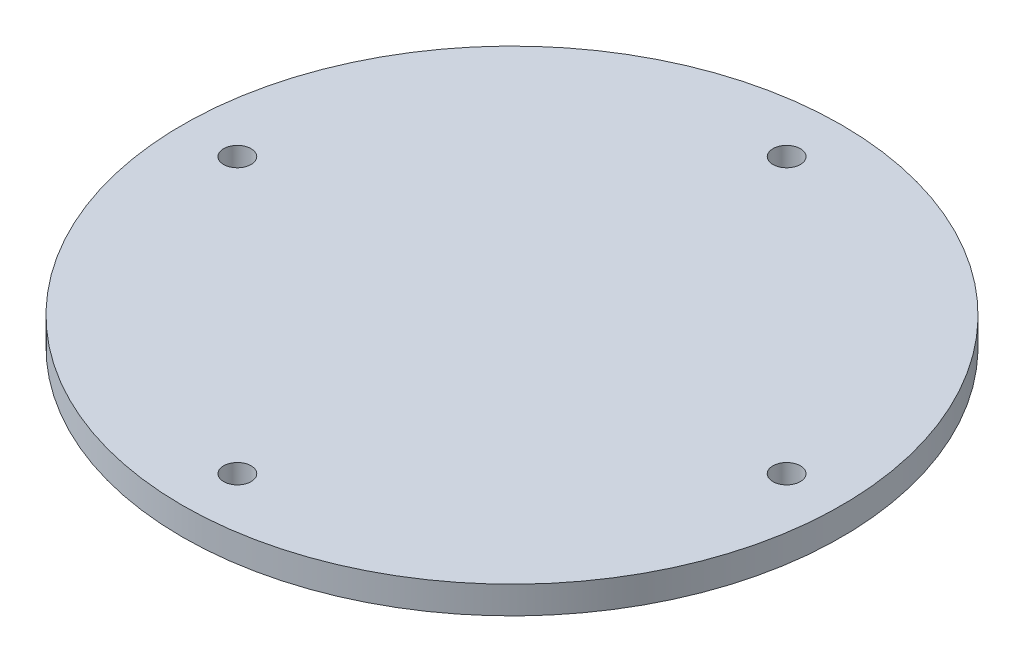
from build123d import *

# Parameters (mm, degrees)
SKETCH1_R           = 30
SKETCH1_R_2         = 1.25
BOSS_EXTRUDE1_DEPTH = 2.5


with BuildPart() as part:
    # Sketch1 → Boss-Extrude1 (new body)
    with BuildSketch(Plane(origin=(0, 0, 0), x_dir=(1, 0, 0), z_dir=(0, 1, 0))):
        with Locations(Location((0, 0, 0), (0, 0, 270))):
            Circle(SKETCH1_R)
        with Locations(Location((0, 25, 0), (0, 0, 270))):
            Circle(SKETCH1_R_2, mode=Mode.SUBTRACT)
        with Locations(Location((25, 0, 0), (0, 0, 270))):
            Circle(SKETCH1_R_2, mode=Mode.SUBTRACT)
        with Locations(Location((0, -25, 0), (0, 0, 270))):
            Circle(SKETCH1_R_2, mode=Mode.SUBTRACT)
        with Locations(Location((-25, 0, 0), (0, 0, 270))):
            Circle(SKETCH1_R_2, mode=Mode.SUBTRACT)
    extrude(amount=BOSS_EXTRUDE1_DEPTH)


solid = part.part
